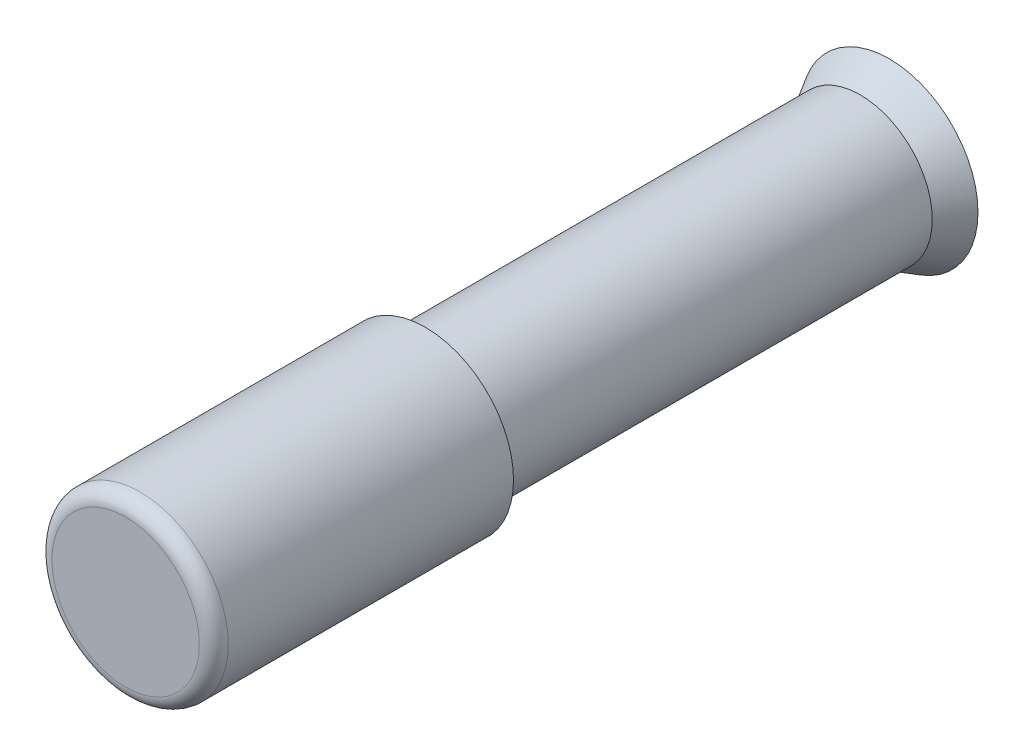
from build123d import *


with BuildPart() as part:
    # Sketch 1 → Revolve 1 (revolve)
    with BuildSketch(Plane(origin=(0, 0, 0), x_dir=(0, 0, -1), z_dir=(1, 0, 0)), mode=Mode.PRIVATE) as revolve_1_sk:
        with BuildLine():
            Line((0, 0), (0, 2.016125))
            ThreePointArc((0, 2.016125), (0.116241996, 2.296758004), (0.396875, 2.413))
            Line((0.396875, 2.413), (8.2042, 2.413))
            Line((8.2042, 2.413), (8.2042, 1.9685))
            Line((8.2042, 1.9685), (20.11045, 1.9685))
            Line((20.11045, 1.9685), (20.9042, 2.426771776))
            ThreePointArc((20.9042, 2.426771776), (21.26454367, 1.237089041), (21.386212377, 0))
            Line((21.386212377, 0), (0, 0))
        make_face()
    revolve(revolve_1_sk.sketch.rotate(Axis((0, 0, 0), (0, 0, -1)), 90), axis=Axis((0, 0, 0), (0, 0, -1)))


solid = part.part
